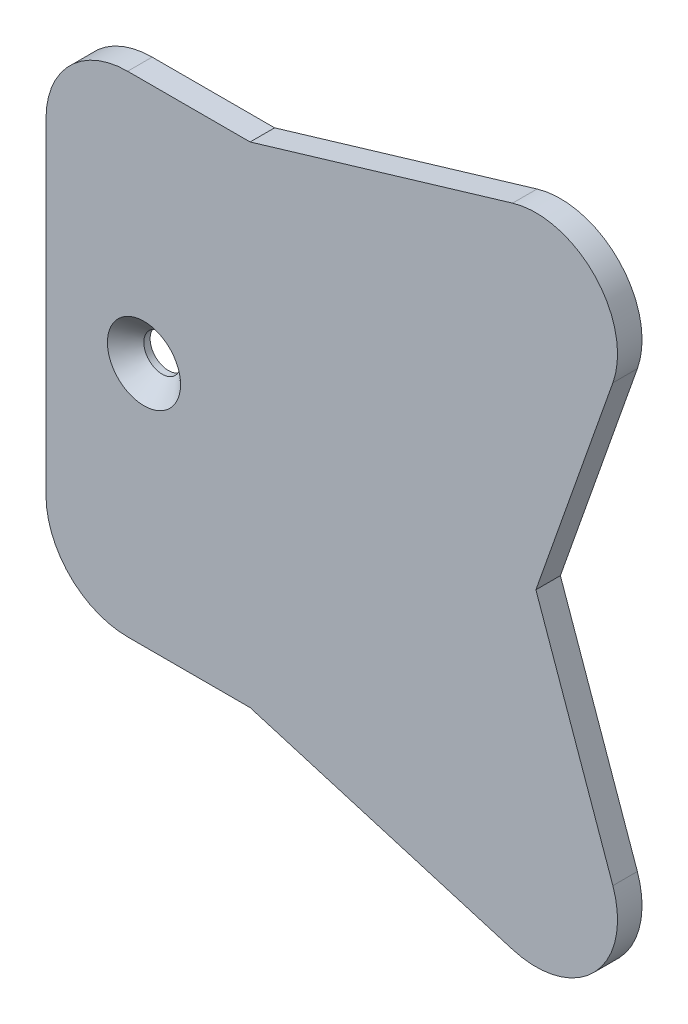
ISO-10303-21;
HEADER;
FILE_DESCRIPTION(('STEP AP214'),'2;1');
FILE_NAME('part.step','',(''),(''),'','','');
FILE_SCHEMA(('AUTOMOTIVE_DESIGN { 1 0 10303 214 1 1 1 1 }'));
ENDSEC;
DATA;
#1=APPLICATION_CONTEXT('core data for automotive mechanical design processes');
#2=APPLICATION_PROTOCOL_DEFINITION('international standard','automotive_design',2000,#1);
#3=PRODUCT_CONTEXT('',#1,'mechanical');
#4=PRODUCT('Part','Part','',(#3));
#5=PRODUCT_RELATED_PRODUCT_CATEGORY('part','',(#4));
#6=PRODUCT_DEFINITION_FORMATION('','',#4);
#7=PRODUCT_DEFINITION_CONTEXT('part definition',#1,'design');
#8=PRODUCT_DEFINITION('design','',#6,#7);
#9=PRODUCT_DEFINITION_SHAPE('','',#8);
#10=(LENGTH_UNIT() NAMED_UNIT(*) SI_UNIT(.MILLI.,.METRE.));
#11=(NAMED_UNIT(*) PLANE_ANGLE_UNIT() SI_UNIT($,.RADIAN.));
#12=(NAMED_UNIT(*) SI_UNIT($,.STERADIAN.) SOLID_ANGLE_UNIT());
#13=UNCERTAINTY_MEASURE_WITH_UNIT(LENGTH_MEASURE(1.E-05),#10,'distance_accuracy_value','');
#14=(GEOMETRIC_REPRESENTATION_CONTEXT(3) GLOBAL_UNCERTAINTY_ASSIGNED_CONTEXT((#13)) GLOBAL_UNIT_ASSIGNED_CONTEXT((#10,
#11,#12)) REPRESENTATION_CONTEXT('',''));
#15=CARTESIAN_POINT('',(0.,0.,0.));
#16=DIRECTION('',(0.,0.,1.));
#17=DIRECTION('',(1.,0.,0.));
#18=AXIS2_PLACEMENT_3D('',#15,#16,#17);
#19=CARTESIAN_POINT('',(69.4280904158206,-26.6666666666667,-3.));
#20=DIRECTION('',(0.942809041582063,0.333333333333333,0.));
#21=DIRECTION('',(-0.333333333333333,0.942809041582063,0.));
#22=AXIS2_PLACEMENT_3D('',#19,#20,#21);
#23=PLANE('',#22);
#24=DIRECTION('',(-0.333333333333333,0.942809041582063,0.));
#25=VECTOR('',#24,1.);
#26=CARTESIAN_POINT('',(69.4280904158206,-26.6666666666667,0.));
#27=LINE('',#26,#25);
#28=CARTESIAN_POINT('',(69.4280904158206,-26.6666666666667,0.));
#29=VERTEX_POINT('',#28);
#30=CARTESIAN_POINT('',(60.,0.,0.));
#31=VERTEX_POINT('',#30);
#32=EDGE_CURVE('E152',#29,#31,#27,.T.);
#33=ORIENTED_EDGE('',*,*,#32,.F.);
#34=DIRECTION('',(0.,0.,1.));
#35=VECTOR('',#34,1.);
#36=CARTESIAN_POINT('',(69.4280904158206,-26.6666666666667,-3.));
#37=LINE('',#36,#35);
#38=CARTESIAN_POINT('',(69.4280904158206,-26.6666666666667,-3.));
#39=VERTEX_POINT('',#38);
#40=EDGE_CURVE('E11',#39,#29,#37,.T.);
#41=ORIENTED_EDGE('',*,*,#40,.F.);
#42=DIRECTION('',(-0.333333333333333,0.942809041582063,0.));
#43=VECTOR('',#42,1.);
#44=CARTESIAN_POINT('',(69.4280904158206,-26.6666666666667,-3.));
#45=LINE('',#44,#43);
#46=CARTESIAN_POINT('',(60.,0.,-3.));
#47=VERTEX_POINT('',#46);
#48=EDGE_CURVE('E182',#39,#47,#45,.T.);
#49=ORIENTED_EDGE('',*,*,#48,.T.);
#50=DIRECTION('',(0.,0.,1.));
#51=VECTOR('',#50,1.);
#52=CARTESIAN_POINT('',(60.,0.,-3.));
#53=LINE('',#52,#51);
#54=EDGE_CURVE('E40',#47,#31,#53,.T.);
#55=ORIENTED_EDGE('',*,*,#54,.T.);
#56=EDGE_LOOP('',(#33,#41,#49,#55));
#57=FACE_BOUND('',#56,.T.);
#58=ADVANCED_FACE('F37',(#57),#23,.T.);
#59=CARTESIAN_POINT('',(60.,-30.,-3.));
#60=DIRECTION('',(0.,0.,1.));
#61=DIRECTION('',(1.,0.,0.));
#62=AXIS2_PLACEMENT_3D('',#59,#60,#61);
#63=CYLINDRICAL_SURFACE('',#62,10.);
#64=CARTESIAN_POINT('',(60.,-30.,0.));
#65=DIRECTION('',(0.,0.,1.));
#66=DIRECTION('',(-1.,0.,0.));
#67=AXIS2_PLACEMENT_3D('',#64,#65,#66);
#68=CIRCLE('',#67,10.);
#69=CARTESIAN_POINT('',(57.1428571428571,-39.5831484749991,0.));
#70=VERTEX_POINT('',#69);
#71=EDGE_CURVE('E180',#70,#29,#68,.T.);
#72=ORIENTED_EDGE('',*,*,#71,.F.);
#73=DIRECTION('',(0.,0.,1.));
#74=VECTOR('',#73,1.);
#75=CARTESIAN_POINT('',(57.1428571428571,-39.5831484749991,-3.));
#76=LINE('',#75,#74);
#77=CARTESIAN_POINT('',(57.1428571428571,-39.5831484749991,-3.));
#78=VERTEX_POINT('',#77);
#79=EDGE_CURVE('E46',#78,#70,#76,.T.);
#80=ORIENTED_EDGE('',*,*,#79,.F.);
#81=CARTESIAN_POINT('',(60.,-30.,-3.));
#82=DIRECTION('',(0.,0.,1.));
#83=DIRECTION('',(-1.,0.,0.));
#84=AXIS2_PLACEMENT_3D('',#81,#82,#83);
#85=CIRCLE('',#84,10.);
#86=EDGE_CURVE('E142',#78,#39,#85,.T.);
#87=ORIENTED_EDGE('',*,*,#86,.T.);
#88=ORIENTED_EDGE('',*,*,#40,.T.);
#89=EDGE_LOOP('',(#72,#80,#87,#88));
#90=FACE_BOUND('',#89,.T.);
#91=ADVANCED_FACE('F200',(#90),#63,.T.);
#92=CARTESIAN_POINT('',(25.,-30.,-3.));
#93=DIRECTION('',(-0.285714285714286,-0.95831484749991,0.));
#94=DIRECTION('',(0.95831484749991,-0.285714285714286,0.));
#95=AXIS2_PLACEMENT_3D('',#92,#93,#94);
#96=PLANE('',#95);
#97=DIRECTION('',(0.95831484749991,-0.285714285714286,0.));
#98=VECTOR('',#97,1.);
#99=CARTESIAN_POINT('',(25.,-30.,0.));
#100=LINE('',#99,#98);
#101=CARTESIAN_POINT('',(25.,-30.,0.));
#102=VERTEX_POINT('',#101);
#103=EDGE_CURVE('E129',#102,#70,#100,.T.);
#104=ORIENTED_EDGE('',*,*,#103,.F.);
#105=DIRECTION('',(0.,0.,1.));
#106=VECTOR('',#105,1.);
#107=CARTESIAN_POINT('',(25.,-30.,-3.));
#108=LINE('',#107,#106);
#109=CARTESIAN_POINT('',(25.,-30.,-3.));
#110=VERTEX_POINT('',#109);
#111=EDGE_CURVE('E124',#110,#102,#108,.T.);
#112=ORIENTED_EDGE('',*,*,#111,.F.);
#113=DIRECTION('',(0.95831484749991,-0.285714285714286,0.));
#114=VECTOR('',#113,1.);
#115=CARTESIAN_POINT('',(25.,-30.,-3.));
#116=LINE('',#115,#114);
#117=EDGE_CURVE('E127',#110,#78,#116,.T.);
#118=ORIENTED_EDGE('',*,*,#117,.T.);
#119=ORIENTED_EDGE('',*,*,#79,.T.);
#120=EDGE_LOOP('',(#104,#112,#118,#119));
#121=FACE_BOUND('',#120,.T.);
#122=ADVANCED_FACE('F126',(#121),#96,.T.);
#123=CARTESIAN_POINT('',(10.,-30.,-3.));
#124=DIRECTION('',(0.,-1.,0.));
#125=DIRECTION('',(0.,0.,-1.));
#126=AXIS2_PLACEMENT_3D('',#123,#124,#125);
#127=PLANE('',#126);
#128=DIRECTION('',(1.,0.,0.));
#129=VECTOR('',#128,1.);
#130=CARTESIAN_POINT('',(10.,-30.,0.));
#131=LINE('',#130,#129);
#132=CARTESIAN_POINT('',(10.,-30.,0.));
#133=VERTEX_POINT('',#132);
#134=EDGE_CURVE('E177',#133,#102,#131,.T.);
#135=ORIENTED_EDGE('',*,*,#134,.F.);
#136=DIRECTION('',(0.,0.,1.));
#137=VECTOR('',#136,1.);
#138=CARTESIAN_POINT('',(10.,-30.,-3.));
#139=LINE('',#138,#137);
#140=CARTESIAN_POINT('',(10.,-30.,-3.));
#141=VERTEX_POINT('',#140);
#142=EDGE_CURVE('E134',#141,#133,#139,.T.);
#143=ORIENTED_EDGE('',*,*,#142,.F.);
#144=DIRECTION('',(1.,0.,0.));
#145=VECTOR('',#144,1.);
#146=CARTESIAN_POINT('',(10.,-30.,-3.));
#147=LINE('',#146,#145);
#148=EDGE_CURVE('E140',#141,#110,#147,.T.);
#149=ORIENTED_EDGE('',*,*,#148,.T.);
#150=ORIENTED_EDGE('',*,*,#111,.T.);
#151=EDGE_LOOP('',(#135,#143,#149,#150));
#152=FACE_BOUND('',#151,.T.);
#153=ADVANCED_FACE('F144',(#152),#127,.T.);
#154=CARTESIAN_POINT('',(10.,-20.,-3.));
#155=DIRECTION('',(0.,0.,1.));
#156=DIRECTION('',(1.,0.,0.));
#157=AXIS2_PLACEMENT_3D('',#154,#155,#156);
#158=CYLINDRICAL_SURFACE('',#157,10.);
#159=CARTESIAN_POINT('',(10.,-20.,0.));
#160=DIRECTION('',(0.,0.,1.));
#161=DIRECTION('',(1.,0.,0.));
#162=AXIS2_PLACEMENT_3D('',#159,#160,#161);
#163=CIRCLE('',#162,10.);
#164=CARTESIAN_POINT('',(0.,-20.,0.));
#165=VERTEX_POINT('',#164);
#166=EDGE_CURVE('E174',#165,#133,#163,.T.);
#167=ORIENTED_EDGE('',*,*,#166,.F.);
#168=DIRECTION('',(0.,0.,1.));
#169=VECTOR('',#168,1.);
#170=CARTESIAN_POINT('',(0.,-20.,-3.));
#171=LINE('',#170,#169);
#172=CARTESIAN_POINT('',(0.,-20.,-3.));
#173=VERTEX_POINT('',#172);
#174=EDGE_CURVE('E186',#173,#165,#171,.T.);
#175=ORIENTED_EDGE('',*,*,#174,.F.);
#176=CARTESIAN_POINT('',(10.,-20.,-3.));
#177=DIRECTION('',(0.,0.,1.));
#178=DIRECTION('',(1.,0.,0.));
#179=AXIS2_PLACEMENT_3D('',#176,#177,#178);
#180=CIRCLE('',#179,10.);
#181=EDGE_CURVE('E145',#173,#141,#180,.T.);
#182=ORIENTED_EDGE('',*,*,#181,.T.);
#183=ORIENTED_EDGE('',*,*,#142,.T.);
#184=EDGE_LOOP('',(#167,#175,#182,#183));
#185=FACE_BOUND('',#184,.T.);
#186=ADVANCED_FACE('F213',(#185),#158,.T.);
#187=CARTESIAN_POINT('',(0.,-20.,-3.));
#188=DIRECTION('',(-1.,0.,0.));
#189=DIRECTION('',(0.,0.,1.));
#190=AXIS2_PLACEMENT_3D('',#187,#188,#189);
#191=PLANE('',#190);
#192=DIRECTION('',(0.,-1.,0.));
#193=VECTOR('',#192,1.);
#194=CARTESIAN_POINT('',(0.,-20.,0.));
#195=LINE('',#194,#193);
#196=CARTESIAN_POINT('',(0.,20.,0.));
#197=VERTEX_POINT('',#196);
#198=EDGE_CURVE('E171',#197,#165,#195,.T.);
#199=ORIENTED_EDGE('',*,*,#198,.F.);
#200=DIRECTION('',(0.,0.,1.));
#201=VECTOR('',#200,1.);
#202=CARTESIAN_POINT('',(0.,20.,-3.));
#203=LINE('',#202,#201);
#204=CARTESIAN_POINT('',(0.,20.,-3.));
#205=VERTEX_POINT('',#204);
#206=EDGE_CURVE('E188',#205,#197,#203,.T.);
#207=ORIENTED_EDGE('',*,*,#206,.F.);
#208=DIRECTION('',(0.,-1.,0.));
#209=VECTOR('',#208,1.);
#210=CARTESIAN_POINT('',(0.,-20.,-3.));
#211=LINE('',#210,#209);
#212=EDGE_CURVE('E147',#205,#173,#211,.T.);
#213=ORIENTED_EDGE('',*,*,#212,.T.);
#214=ORIENTED_EDGE('',*,*,#174,.T.);
#215=EDGE_LOOP('',(#199,#207,#213,#214));
#216=FACE_BOUND('',#215,.T.);
#217=ADVANCED_FACE('F216',(#216),#191,.T.);
#218=CARTESIAN_POINT('',(10.,20.,-3.));
#219=DIRECTION('',(0.,0.,1.));
#220=DIRECTION('',(1.,0.,0.));
#221=AXIS2_PLACEMENT_3D('',#218,#219,#220);
#222=CYLINDRICAL_SURFACE('',#221,10.);
#223=CARTESIAN_POINT('',(10.,20.,0.));
#224=DIRECTION('',(0.,0.,1.));
#225=DIRECTION('',(-1.,0.,0.));
#226=AXIS2_PLACEMENT_3D('',#223,#224,#225);
#227=CIRCLE('',#226,10.);
#228=CARTESIAN_POINT('',(10.,30.,0.));
#229=VERTEX_POINT('',#228);
#230=EDGE_CURVE('E168',#229,#197,#227,.T.);
#231=ORIENTED_EDGE('',*,*,#230,.F.);
#232=DIRECTION('',(0.,0.,1.));
#233=VECTOR('',#232,1.);
#234=CARTESIAN_POINT('',(10.,30.,-3.));
#235=LINE('',#234,#233);
#236=CARTESIAN_POINT('',(10.,30.,-3.));
#237=VERTEX_POINT('',#236);
#238=EDGE_CURVE('E190',#237,#229,#235,.T.);
#239=ORIENTED_EDGE('',*,*,#238,.F.);
#240=CARTESIAN_POINT('',(10.,20.,-3.));
#241=DIRECTION('',(0.,0.,1.));
#242=DIRECTION('',(-1.,0.,0.));
#243=AXIS2_PLACEMENT_3D('',#240,#241,#242);
#244=CIRCLE('',#243,10.);
#245=EDGE_CURVE('E279',#237,#205,#244,.T.);
#246=ORIENTED_EDGE('',*,*,#245,.T.);
#247=ORIENTED_EDGE('',*,*,#206,.T.);
#248=EDGE_LOOP('',(#231,#239,#246,#247));
#249=FACE_BOUND('',#248,.T.);
#250=ADVANCED_FACE('F220',(#249),#222,.T.);
#251=CARTESIAN_POINT('',(10.,30.,-3.));
#252=DIRECTION('',(0.,1.,0.));
#253=DIRECTION('',(0.,0.,1.));
#254=AXIS2_PLACEMENT_3D('',#251,#252,#253);
#255=PLANE('',#254);
#256=DIRECTION('',(-1.,0.,0.));
#257=VECTOR('',#256,1.);
#258=CARTESIAN_POINT('',(10.,30.,0.));
#259=LINE('',#258,#257);
#260=CARTESIAN_POINT('',(25.,30.,0.));
#261=VERTEX_POINT('',#260);
#262=EDGE_CURVE('E165',#261,#229,#259,.T.);
#263=ORIENTED_EDGE('',*,*,#262,.F.);
#264=DIRECTION('',(0.,0.,1.));
#265=VECTOR('',#264,1.);
#266=CARTESIAN_POINT('',(25.,30.,-3.));
#267=LINE('',#266,#265);
#268=CARTESIAN_POINT('',(25.,30.,-3.));
#269=VERTEX_POINT('',#268);
#270=EDGE_CURVE('E192',#269,#261,#267,.T.);
#271=ORIENTED_EDGE('',*,*,#270,.F.);
#272=DIRECTION('',(-1.,0.,0.));
#273=VECTOR('',#272,1.);
#274=CARTESIAN_POINT('',(10.,30.,-3.));
#275=LINE('',#274,#273);
#276=EDGE_CURVE('E276',#269,#237,#275,.T.);
#277=ORIENTED_EDGE('',*,*,#276,.T.);
#278=ORIENTED_EDGE('',*,*,#238,.T.);
#279=EDGE_LOOP('',(#263,#271,#277,#278));
#280=FACE_BOUND('',#279,.T.);
#281=ADVANCED_FACE('F224',(#280),#255,.T.);
#282=CARTESIAN_POINT('',(25.,30.,-3.));
#283=DIRECTION('',(-0.285714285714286,0.95831484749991,0.));
#284=DIRECTION('',(-0.95831484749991,-0.285714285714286,0.));
#285=AXIS2_PLACEMENT_3D('',#282,#283,#284);
#286=PLANE('',#285);
#287=DIRECTION('',(-0.95831484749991,-0.285714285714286,0.));
#288=VECTOR('',#287,1.);
#289=CARTESIAN_POINT('',(25.,30.,0.));
#290=LINE('',#289,#288);
#291=CARTESIAN_POINT('',(57.1428571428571,39.5831484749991,0.));
#292=VERTEX_POINT('',#291);
#293=EDGE_CURVE('E162',#292,#261,#290,.T.);
#294=ORIENTED_EDGE('',*,*,#293,.F.);
#295=DIRECTION('',(0.,0.,1.));
#296=VECTOR('',#295,1.);
#297=CARTESIAN_POINT('',(57.1428571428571,39.5831484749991,-3.));
#298=LINE('',#297,#296);
#299=CARTESIAN_POINT('',(57.1428571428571,39.5831484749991,-3.));
#300=VERTEX_POINT('',#299);
#301=EDGE_CURVE('E194',#300,#292,#298,.T.);
#302=ORIENTED_EDGE('',*,*,#301,.F.);
#303=DIRECTION('',(-0.95831484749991,-0.285714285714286,0.));
#304=VECTOR('',#303,1.);
#305=CARTESIAN_POINT('',(25.,30.,-3.));
#306=LINE('',#305,#304);
#307=EDGE_CURVE('E273',#300,#269,#306,.T.);
#308=ORIENTED_EDGE('',*,*,#307,.T.);
#309=ORIENTED_EDGE('',*,*,#270,.T.);
#310=EDGE_LOOP('',(#294,#302,#308,#309));
#311=FACE_BOUND('',#310,.T.);
#312=ADVANCED_FACE('F228',(#311),#286,.T.);
#313=CARTESIAN_POINT('',(60.,30.,-3.));
#314=DIRECTION('',(0.,0.,1.));
#315=DIRECTION('',(1.,0.,0.));
#316=AXIS2_PLACEMENT_3D('',#313,#314,#315);
#317=CYLINDRICAL_SURFACE('',#316,10.);
#318=CARTESIAN_POINT('',(60.,30.,0.));
#319=DIRECTION('',(0.,0.,1.));
#320=DIRECTION('',(1.,0.,0.));
#321=AXIS2_PLACEMENT_3D('',#318,#319,#320);
#322=CIRCLE('',#321,10.);
#323=CARTESIAN_POINT('',(69.4280904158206,26.6666666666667,0.));
#324=VERTEX_POINT('',#323);
#325=EDGE_CURVE('E159',#324,#292,#322,.T.);
#326=ORIENTED_EDGE('',*,*,#325,.F.);
#327=DIRECTION('',(0.,0.,1.));
#328=VECTOR('',#327,1.);
#329=CARTESIAN_POINT('',(69.4280904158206,26.6666666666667,-3.));
#330=LINE('',#329,#328);
#331=CARTESIAN_POINT('',(69.4280904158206,26.6666666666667,-3.));
#332=VERTEX_POINT('',#331);
#333=EDGE_CURVE('E195',#332,#324,#330,.T.);
#334=ORIENTED_EDGE('',*,*,#333,.F.);
#335=CARTESIAN_POINT('',(60.,30.,-3.));
#336=DIRECTION('',(0.,0.,1.));
#337=DIRECTION('',(1.,0.,0.));
#338=AXIS2_PLACEMENT_3D('',#335,#336,#337);
#339=CIRCLE('',#338,10.);
#340=EDGE_CURVE('E270',#332,#300,#339,.T.);
#341=ORIENTED_EDGE('',*,*,#340,.T.);
#342=ORIENTED_EDGE('',*,*,#301,.T.);
#343=EDGE_LOOP('',(#326,#334,#341,#342));
#344=FACE_BOUND('',#343,.T.);
#345=ADVANCED_FACE('F232',(#344),#317,.T.);
#346=CARTESIAN_POINT('',(69.4280904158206,26.6666666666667,-3.));
#347=DIRECTION('',(0.942809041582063,-0.333333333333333,0.));
#348=DIRECTION('',(0.333333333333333,0.942809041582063,0.));
#349=AXIS2_PLACEMENT_3D('',#346,#347,#348);
#350=PLANE('',#349);
#351=DIRECTION('',(0.333333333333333,0.942809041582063,0.));
#352=VECTOR('',#351,1.);
#353=CARTESIAN_POINT('',(69.4280904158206,26.6666666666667,0.));
#354=LINE('',#353,#352);
#355=EDGE_CURVE('E155',#31,#324,#354,.T.);
#356=ORIENTED_EDGE('',*,*,#355,.F.);
#357=ORIENTED_EDGE('',*,*,#54,.F.);
#358=DIRECTION('',(0.333333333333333,0.942809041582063,0.));
#359=VECTOR('',#358,1.);
#360=CARTESIAN_POINT('',(69.4280904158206,26.6666666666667,-3.));
#361=LINE('',#360,#359);
#362=EDGE_CURVE('E268',#47,#332,#361,.T.);
#363=ORIENTED_EDGE('',*,*,#362,.T.);
#364=ORIENTED_EDGE('',*,*,#333,.T.);
#365=EDGE_LOOP('',(#356,#357,#363,#364));
#366=FACE_BOUND('',#365,.T.);
#367=ADVANCED_FACE('F197',(#366),#350,.T.);
#368=CARTESIAN_POINT('',(60.,30.,-3.));
#369=DIRECTION('',(0.,0.,1.));
#370=DIRECTION('',(1.,0.,0.));
#371=AXIS2_PLACEMENT_3D('',#368,#369,#370);
#372=PLANE('',#371);
#373=CARTESIAN_POINT('',(12.,0.,-3.));
#374=DIRECTION('',(0.,0.,1.));
#375=DIRECTION('',(1.,0.,0.));
#376=AXIS2_PLACEMENT_3D('',#373,#374,#375);
#377=CIRCLE('',#376,2.25);
#378=CARTESIAN_POINT('',(14.25,0.,-3.));
#379=VERTEX_POINT('',#378);
#380=EDGE_CURVE('E156',#379,#379,#377,.T.);
#381=ORIENTED_EDGE('',*,*,#380,.T.);
#382=EDGE_LOOP('',(#381));
#383=FACE_BOUND('',#382,.T.);
#384=ORIENTED_EDGE('',*,*,#48,.F.);
#385=ORIENTED_EDGE('',*,*,#86,.F.);
#386=ORIENTED_EDGE('',*,*,#117,.F.);
#387=ORIENTED_EDGE('',*,*,#148,.F.);
#388=ORIENTED_EDGE('',*,*,#181,.F.);
#389=ORIENTED_EDGE('',*,*,#212,.F.);
#390=ORIENTED_EDGE('',*,*,#245,.F.);
#391=ORIENTED_EDGE('',*,*,#276,.F.);
#392=ORIENTED_EDGE('',*,*,#307,.F.);
#393=ORIENTED_EDGE('',*,*,#340,.F.);
#394=ORIENTED_EDGE('',*,*,#362,.F.);
#395=EDGE_LOOP('',(#384,#385,#386,#387,#388,#389,#390,#391,#392,#393,#394));
#396=FACE_BOUND('',#395,.T.);
#397=ADVANCED_FACE('F138',(#383,#396),#372,.F.);
#398=CARTESIAN_POINT('',(60.,30.,0.));
#399=DIRECTION('',(0.,0.,1.));
#400=DIRECTION('',(1.,0.,0.));
#401=AXIS2_PLACEMENT_3D('',#398,#399,#400);
#402=PLANE('',#401);
#403=CARTESIAN_POINT('',(12.,0.,0.));
#404=DIRECTION('',(0.,0.,1.));
#405=DIRECTION('',(1.,0.,0.));
#406=AXIS2_PLACEMENT_3D('',#403,#404,#405);
#407=CIRCLE('',#406,4.48);
#408=CARTESIAN_POINT('',(16.48,0.,0.));
#409=VERTEX_POINT('',#408);
#410=EDGE_CURVE('E262',#409,#409,#407,.T.);
#411=ORIENTED_EDGE('',*,*,#410,.F.);
#412=EDGE_LOOP('',(#411));
#413=FACE_BOUND('',#412,.T.);
#414=ORIENTED_EDGE('',*,*,#32,.T.);
#415=ORIENTED_EDGE('',*,*,#355,.T.);
#416=ORIENTED_EDGE('',*,*,#325,.T.);
#417=ORIENTED_EDGE('',*,*,#293,.T.);
#418=ORIENTED_EDGE('',*,*,#262,.T.);
#419=ORIENTED_EDGE('',*,*,#230,.T.);
#420=ORIENTED_EDGE('',*,*,#198,.T.);
#421=ORIENTED_EDGE('',*,*,#166,.T.);
#422=ORIENTED_EDGE('',*,*,#134,.T.);
#423=ORIENTED_EDGE('',*,*,#103,.T.);
#424=ORIENTED_EDGE('',*,*,#71,.T.);
#425=EDGE_LOOP('',(#414,#415,#416,#417,#418,#419,#420,#421,#422,#423,#424));
#426=FACE_BOUND('',#425,.T.);
#427=ADVANCED_FACE('F199',(#413,#426),#402,.T.);
#428=CARTESIAN_POINT('',(12.,0.,0.));
#429=DIRECTION('',(0.,0.,1.));
#430=DIRECTION('',(1.,0.,0.));
#431=AXIS2_PLACEMENT_3D('',#428,#429,#430);
#432=CYLINDRICAL_SURFACE('',#431,2.25);
#433=ORIENTED_EDGE('',*,*,#380,.F.);
#434=EDGE_LOOP('',(#433));
#435=FACE_BOUND('',#434,.T.);
#436=CARTESIAN_POINT('',(12.,0.,-2.23));
#437=DIRECTION('',(0.,0.,1.));
#438=DIRECTION('',(1.,0.,0.));
#439=AXIS2_PLACEMENT_3D('',#436,#437,#438);
#440=CIRCLE('',#439,2.25);
#441=CARTESIAN_POINT('',(14.25,0.,-2.23));
#442=VERTEX_POINT('',#441);
#443=EDGE_CURVE('E259',#442,#442,#440,.T.);
#444=ORIENTED_EDGE('',*,*,#443,.T.);
#445=EDGE_LOOP('',(#444));
#446=FACE_BOUND('',#445,.T.);
#447=ADVANCED_FACE('F244',(#435,#446),#432,.F.);
#448=CARTESIAN_POINT('',(12.,0.,0.));
#449=DIRECTION('',(0.,0.,1.));
#450=DIRECTION('',(1.,0.,0.));
#451=AXIS2_PLACEMENT_3D('',#448,#449,#450);
#452=CONICAL_SURFACE('',#451,4.48,0.785398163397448);
#453=ORIENTED_EDGE('',*,*,#443,.F.);
#454=EDGE_LOOP('',(#453));
#455=FACE_BOUND('',#454,.T.);
#456=ORIENTED_EDGE('',*,*,#410,.T.);
#457=EDGE_LOOP('',(#456));
#458=FACE_BOUND('',#457,.T.);
#459=ADVANCED_FACE('F250',(#455,#458),#452,.F.);
#460=CLOSED_SHELL('',(#58,#91,#122,#153,#186,#217,#250,#281,#312,#345,#367,#397,#427,#447,#459));
#461=MANIFOLD_SOLID_BREP('B2',#460);
#462=ADVANCED_BREP_SHAPE_REPRESENTATION('',(#18,#461),#14);
#463=SHAPE_DEFINITION_REPRESENTATION(#9,#462);
ENDSEC;
END-ISO-10303-21;
